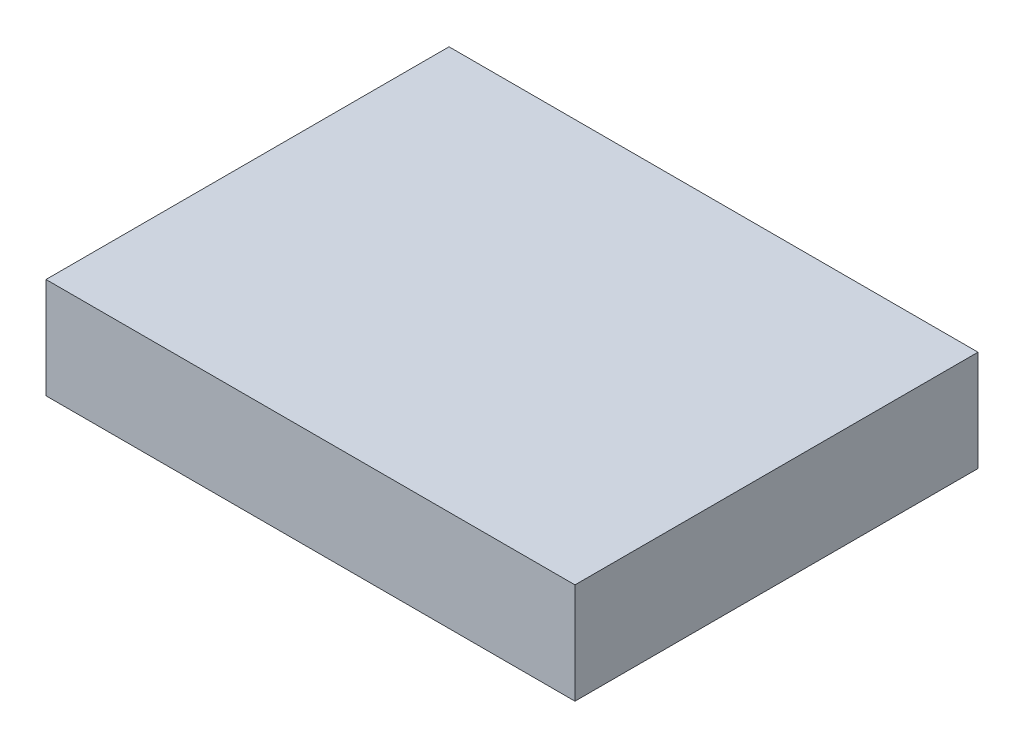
from build123d import *

# Parameters (mm, degrees)
SKETCH1_W           = 10.5
SKETCH1_H           = 8
BOSS_EXTRUDE1_DEPTH = 2
SKETCH2_2_W         = 1.25
SKETCH2_2_H         = 1.25
CUT_EXTRUDE1_DEPTH  = 6


with BuildPart() as part:
    # Sketch1 → Boss-Extrude1 (new body)
    with BuildSketch(Plane(origin=(0, 0, 0), x_dir=(1, 0, 0), z_dir=(0, 1, 0))):
        Rectangle(SKETCH1_W, SKETCH1_H)
    extrude(amount=BOSS_EXTRUDE1_DEPTH)

    # Sketch2_2 → Cut-Extrude1 (cut)
    with BuildSketch(Plane(origin=(0, 0, -4), x_dir=(-1, 0, 0), z_dir=(0, 0, -1))):
        with Locations((1.25, 1)):
            Rectangle(SKETCH2_2_W, SKETCH2_2_H)
        with Locations((-3.75, 1)):
            Rectangle(SKETCH2_2_W, SKETCH2_2_H)
        with Locations((-1.25, 1)):
            Rectangle(SKETCH2_2_W, SKETCH2_2_H)
        with Locations((3.75, 1)):
            Rectangle(SKETCH2_2_W, SKETCH2_2_H)
    extrude(amount=-CUT_EXTRUDE1_DEPTH, mode=Mode.SUBTRACT)


solid = part.part
